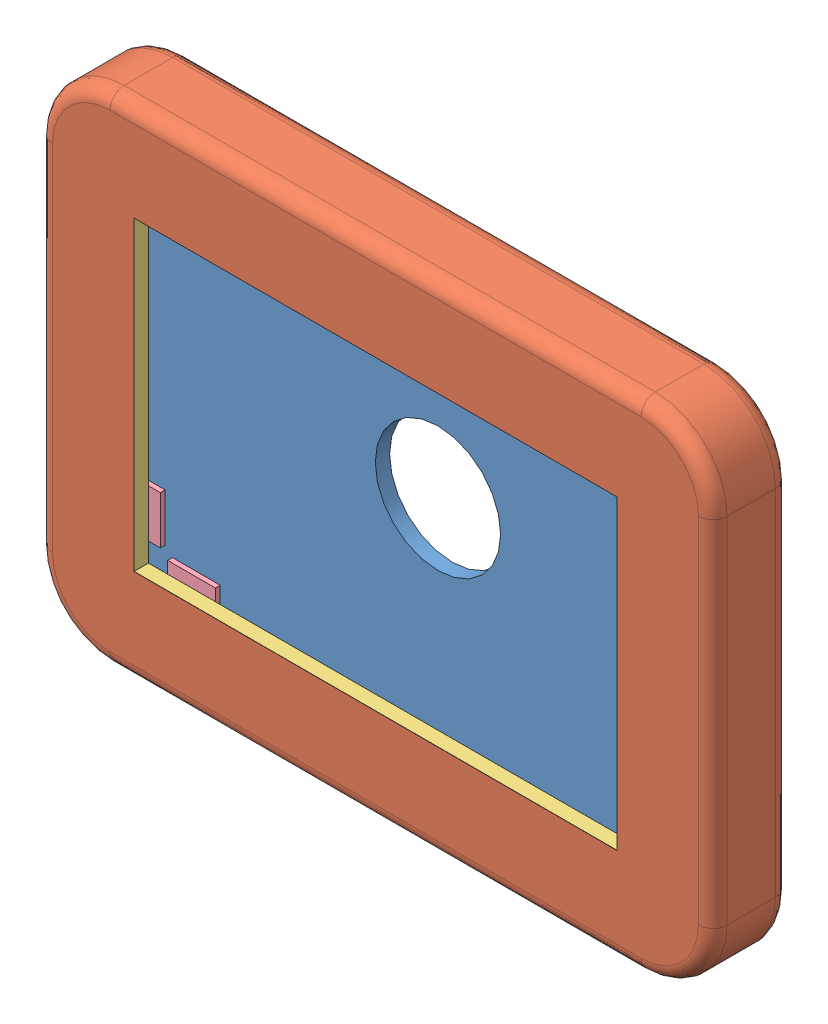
SolidWorks assembly jupe.SLDASM, configuration Défaut (file format 3100). Lengths in mm.
Overall size (282 208 32.2).
11 component instances, 4 part files, 30 mates.
Components (placement in the parent):
- plateau 6mm-1: plateau 6mm.SLDPRT [Défaut] at origin size (262 188 6)
- toile-1: toile.SLDPRT [Défaut] at (0 0 -0.1) size (282 208 32.2)
- assise 6mm-1: assise 6mm.SLDPRT [Défaut] at (0 0 32) x (1 0 0) z (0 0 -1) size (262 188 6)
- cale pliee 20mm-1: cale pliee 20mm.SLDPRT [Défaut] at (114 54 26) x (0 -1 0) z (1 0 0) size (20 20 17)
- cale pliee 20mm-2: cale pliee 20mm.SLDPRT [Défaut] at (-111 -77 26) x (-1 0 0) z (0 -1 0) size (20 20 17)
- cale pliee 20mm-3: cale pliee 20mm.SLDPRT [Défaut] at (91 -77 26) x (-1 0 0) z (0 -1 0) size (20 20 17)
- cale pliee 20mm-4: cale pliee 20mm.SLDPRT [Défaut] at (-114 74 26) x (0 1 0) z (-1 0 0) size (20 20 17)
- cale pliee 20mm-5: cale pliee 20mm.SLDPRT [Défaut] at (-114 -54 26) x (0 1 0) z (-1 0 0) size (20 20 17)
- cale pliee 20mm-6: cale pliee 20mm.SLDPRT [Défaut] at (111 77 26) x (1 0 0) z (0 1 0) size (20 20 17)
- cale pliee 20mm-7: cale pliee 20mm.SLDPRT [Défaut] at (-91 77 26) x (1 0 0) z (0 1 0) size (20 20 17)
- cale pliee 20mm-8: cale pliee 20mm.SLDPRT [Défaut] at (114 -74 26) x (0 -1 0) z (1 0 0) size (20 20 17)
Mates (geometry in assembly coordinates):
- Coïncidente1: coincident aligned: plane of cale pliee 20mm-1 through (129 74 6) normal (0 0 -1); plane of cale pliee 20mm-6 through (91 92 6) normal (0 0 -1)
- Coïncidente2: coincident aligned: plane of cale pliee 20mm-6 through (91 92 6) normal (0 0 -1); plane of cale pliee 20mm-7 through (-111 92 6) normal (0 0 -1)
- Coïncidente3: coincident aligned: plane of cale pliee 20mm-7 through (-111 92 6) normal (0 0 -1); plane of cale pliee 20mm-4 through (-129 54 6) normal (0 0 -1)
- Coïncidente4: coincident aligned: plane of cale pliee 20mm-4 through (-129 54 6) normal (0 0 -1); plane of cale pliee 20mm-5 through (-129 -74 6) normal (0 0 -1)
- Coïncidente5: coincident aligned: plane of cale pliee 20mm-2 through (-91 -92 6) normal (0 0 -1); plane of cale pliee 20mm-5 through (-129 -74 6) normal (0 0 -1)
- Coïncidente6: coincident aligned: plane of cale pliee 20mm-2 through (-91 -92 6) normal (0 0 -1); plane of cale pliee 20mm-3 through (111 -92 6) normal (0 0 -1)
- Coïncidente7: coincident aligned: plane of cale pliee 20mm-3 through (111 -92 6) normal (0 0 -1); plane of cale pliee 20mm-8 through (129 -54 6) normal (0 0 -1)
- Coïncidente8: coincident aligned: plane of assise 6mm-1 through (-111 -94 26) normal (0 -1 0); plane of cale pliee 20mm-3 through (91 -94 8) normal (0 -1 0)
- Coïncidente9: coincident aligned: plane of assise 6mm-1 through (-111 -94 26) normal (0 -1 0); plane of cale pliee 20mm-2 through (-111 -94 8) normal (0 -1 0)
- Coïncidente10: coincident aligned: plane of assise 6mm-1 through (-131 -74 26) normal (-1 0 0); plane of cale pliee 20mm-5 through (-131 -54 8) normal (-1 0 0)
- Coïncidente11: coincident aligned: plane of assise 6mm-1 through (-131 -74 26) normal (-1 0 0); plane of cale pliee 20mm-4 through (-131 74 8) normal (-1 0 0)
- Coïncidente12: coincident aligned: plane of assise 6mm-1 through (-111 94 26) normal (0 1 0); plane of cale pliee 20mm-7 through (-91 94 8) normal (0 1 0)
- Coïncidente13: coincident aligned: plane of assise 6mm-1 through (-111 94 26) normal (0 1 0); plane of cale pliee 20mm-6 through (111 94 8) normal (0 1 0)
- Coïncidente14: coincident aligned: plane of assise 6mm-1 through (131 -74 26) normal (1 0 0); plane of cale pliee 20mm-1 through (131 54 8) normal (1 0 0)
- Coïncidente15: coincident aligned: plane of assise 6mm-1 through (131 -74 26) normal (1 0 0); plane of cale pliee 20mm-8 through (131 -74 8) normal (1 0 0)
- Coïncidente16: coincident anti-aligned: plane of assise 6mm-1 through (-111 -74 26) normal (0 0 -1); plane of cale pliee 20mm-3 through (91 -92 26) normal (0 0 1)
- Coïncidente17: coincident aligned: line of assise 6mm-1; line of cale pliee 20mm-3
- Coïncidente18: coincident anti-aligned: line of assise 6mm-1; line of cale pliee 20mm-2
- Coïncidente19: coincident aligned: line of assise 6mm-1; line of cale pliee 20mm-5
- Coïncidente20: coincident anti-aligned: line of assise 6mm-1; line of cale pliee 20mm-4
- Coïncidente21: coincident aligned: line of assise 6mm-1; line of cale pliee 20mm-7
- Coïncidente22: coincident anti-aligned: line of assise 6mm-1; line of cale pliee 20mm-6
- Coïncidente23: coincident aligned: line of assise 6mm-1; line of cale pliee 20mm-1
- Coïncidente24: coincident anti-aligned: line of assise 6mm-1; line of cale pliee 20mm-8
- Coïncidente25: coincident anti-aligned: plane of plateau 6mm-1 through (-111 74 6) normal (0 0 1); plane of cale pliee 20mm-6 through (91 92 6) normal (0 0 -1)
- Coïncidente26: coincident anti-aligned: line of plateau 6mm-1; line of cale pliee 20mm-1
- Coïncidente27: coincident aligned: line of plateau 6mm-1; line of cale pliee 20mm-6
- Coïncidente28: coincident anti-aligned: plane of plateau 6mm-1 through (-111 74 0) normal (0 0 -1); plane of toile-1 through (-111 74 0) normal (0 0 1)
- Coïncidente29: coincident aligned: plane of toile-1 through (-111 64 32.1) normal (0 -1 0); plane of assise 6mm-1 through (-111 64 26) normal (0 -1 0)
- Coïncidente30: coincident aligned: unknown of toile-1; unknown of assise 6mm-1
